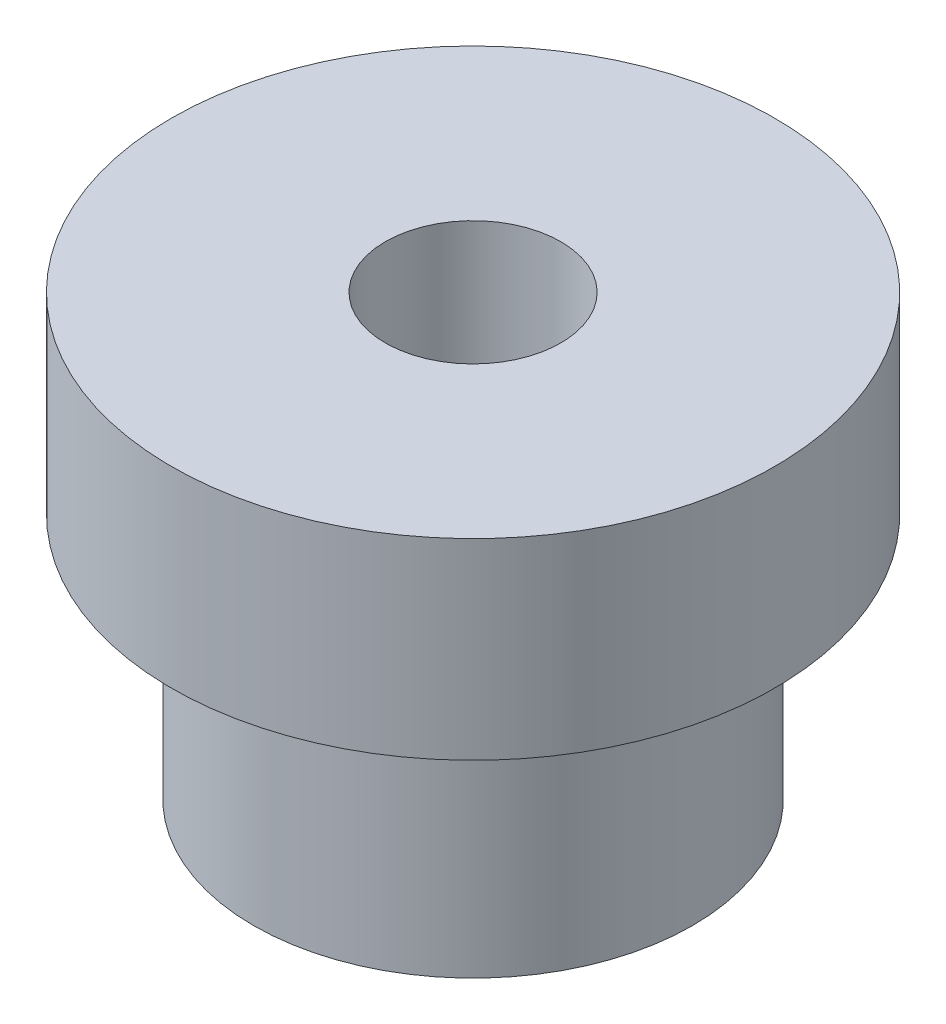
from build123d import *


with BuildPart() as part:
    # Esquisse1 → Base-R_volution (revolve)
    with BuildSketch(Plane.XY, mode=Mode.PRIVATE) as base_r_volution_sk:
        Polygon((1.6, 3.5), (1.6, -4.5), (4, -4.5), (4, 0), (5.5, 0), (5.5, 3.5), align=None)
    revolve(base_r_volution_sk.sketch.rotate(Axis((0, 2.661599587, 0), (0, -1, 0)), 180), axis=Axis((0, 2.661599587, 0), (0, -1, 0)))


solid = part.part
